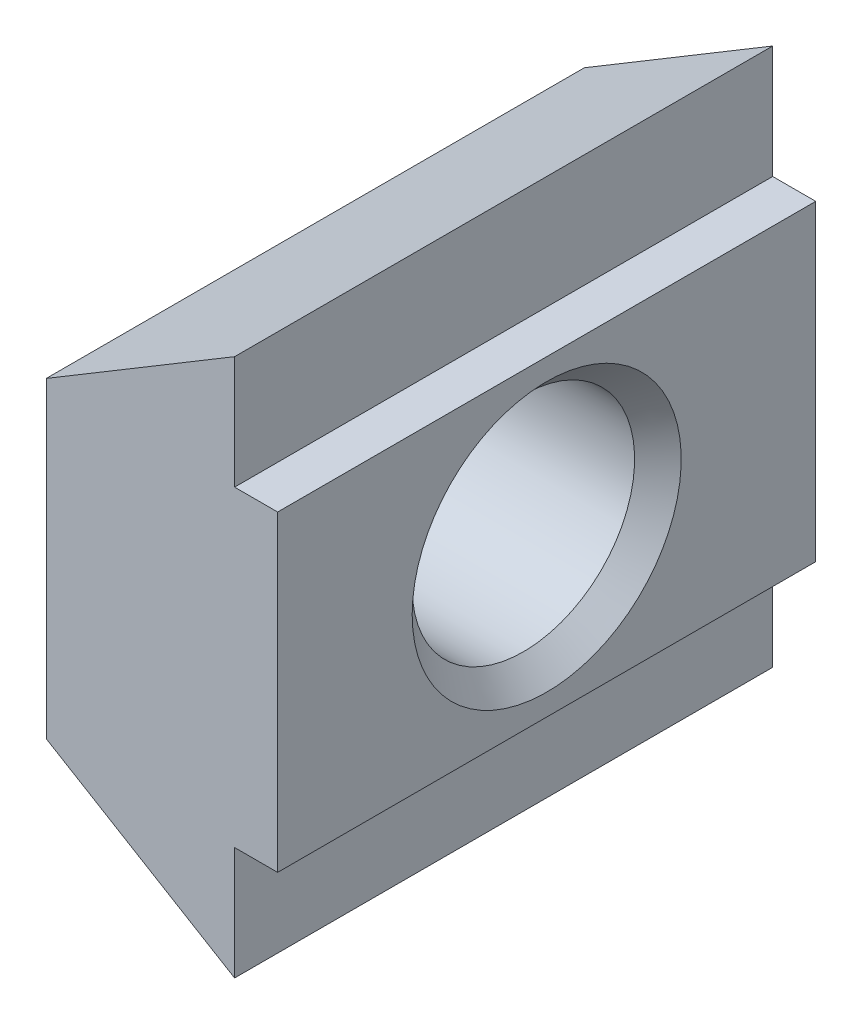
from build123d import *

# Parameters (mm, degrees)
BOSS_EXTRUDE1_DEPTH      = 5
BOSS_EXTRUDE1_DEPTH_BACK = 5


with BuildPart() as part:
    # Sketch1 → Boss-Extrude1 (new, two sides: drawn at the far end of the back side and taken through both)
    with BuildSketch(Plane.XY.offset(-BOSS_EXTRUDE1_DEPTH_BACK)):
        Polygon((-4.3, 2.9), (-4.3, -2.9), (-0.8, -5), (-0.8, -2.9), (0, -2.9), (0, 2.9), (-0.8, 2.9), (-0.8, 5), align=None)
    extrude(amount=BOSS_EXTRUDE1_DEPTH + BOSS_EXTRUDE1_DEPTH_BACK)

    # Sketch2 → Cut-Revolve1 (revolve, cut)
    with BuildSketch(Plane.XY, mode=Mode.PRIVATE) as cut_revolve1_sk:
        Polygon((-4.3, 0), (-4.3, 2.5), (-3.867, 2.067), (-0.433, 2.067), (0, 2.5), (0, 0), align=None)
    revolve(cut_revolve1_sk.sketch.rotate(Axis((0, 0, 0), (-1, 0, 0)), 270), axis=Axis((0, 0, 0), (-1, 0, 0)), mode=Mode.SUBTRACT)


solid = part.part
